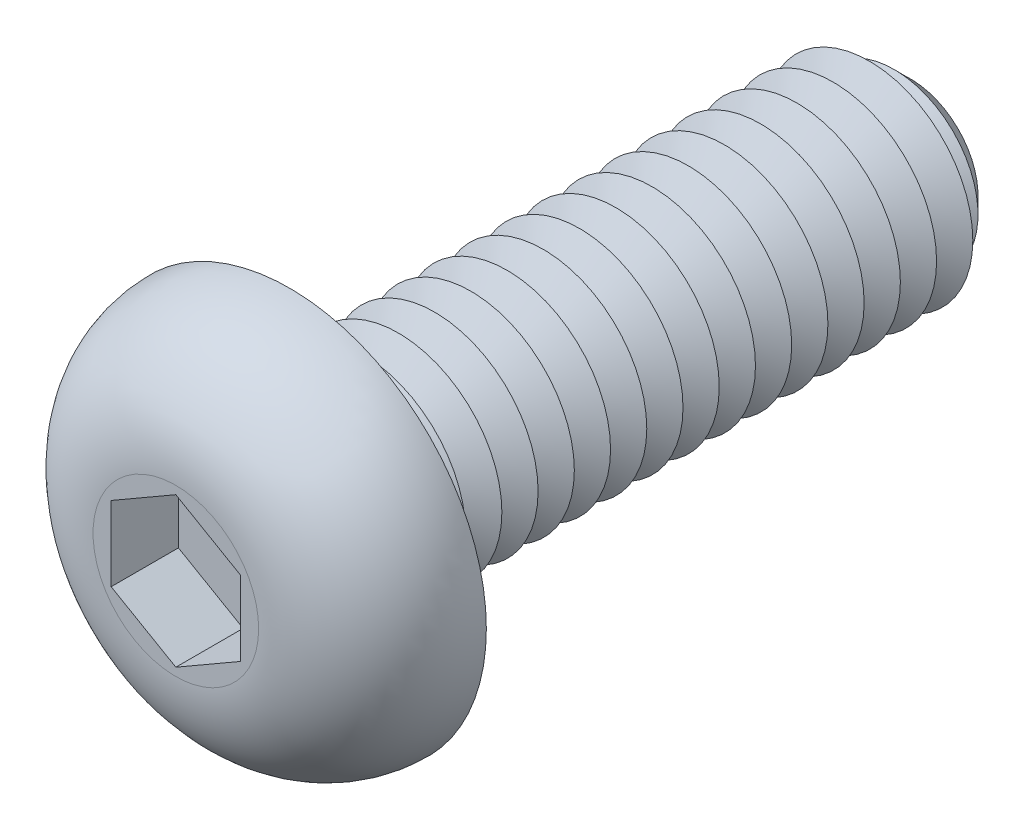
ISO-10303-21;
HEADER;
FILE_DESCRIPTION(('STEP AP214'),'2;1');
FILE_NAME('part.step','',(''),(''),'','','');
FILE_SCHEMA(('AUTOMOTIVE_DESIGN { 1 0 10303 214 1 1 1 1 }'));
ENDSEC;
DATA;
#1=APPLICATION_CONTEXT('core data for automotive mechanical design processes');
#2=APPLICATION_PROTOCOL_DEFINITION('international standard','automotive_design',2000,#1);
#3=PRODUCT_CONTEXT('',#1,'mechanical');
#4=PRODUCT('Part','Part','',(#3));
#5=PRODUCT_RELATED_PRODUCT_CATEGORY('part','',(#4));
#6=PRODUCT_DEFINITION_FORMATION('','',#4);
#7=PRODUCT_DEFINITION_CONTEXT('part definition',#1,'design');
#8=PRODUCT_DEFINITION('design','',#6,#7);
#9=PRODUCT_DEFINITION_SHAPE('','',#8);
#10=(LENGTH_UNIT() NAMED_UNIT(*) SI_UNIT(.MILLI.,.METRE.));
#11=(NAMED_UNIT(*) PLANE_ANGLE_UNIT() SI_UNIT($,.RADIAN.));
#12=(NAMED_UNIT(*) SI_UNIT($,.STERADIAN.) SOLID_ANGLE_UNIT());
#13=UNCERTAINTY_MEASURE_WITH_UNIT(LENGTH_MEASURE(1.E-05),#10,'distance_accuracy_value','');
#14=(GEOMETRIC_REPRESENTATION_CONTEXT(3) GLOBAL_UNCERTAINTY_ASSIGNED_CONTEXT((#13)) GLOBAL_UNIT_ASSIGNED_CONTEXT((#10,
#11,#12)) REPRESENTATION_CONTEXT('',''));
#15=CARTESIAN_POINT('',(0.,0.,0.));
#16=DIRECTION('',(0.,0.,1.));
#17=DIRECTION('',(1.,0.,0.));
#18=AXIS2_PLACEMENT_3D('',#15,#16,#17);
#19=CARTESIAN_POINT('',(0.,0.,-12.));
#20=DIRECTION('',(0.,0.,1.));
#21=DIRECTION('',(1.,0.,0.));
#22=AXIS2_PLACEMENT_3D('',#19,#20,#21);
#23=CYLINDRICAL_SURFACE('',#22,2.);
#24=CARTESIAN_POINT('',(0.,0.,-0.35));
#25=DIRECTION('',(0.,0.,1.));
#26=DIRECTION('',(1.,0.,0.));
#27=AXIS2_PLACEMENT_3D('',#24,#25,#26);
#28=CIRCLE('',#27,2.);
#29=CARTESIAN_POINT('',(2.,0.,-0.35));
#30=VERTEX_POINT('',#29);
#31=EDGE_CURVE('E48',#30,#30,#28,.F.);
#32=ORIENTED_EDGE('',*,*,#31,.T.);
#33=EDGE_LOOP('',(#32));
#34=FACE_BOUND('',#33,.T.);
#35=CARTESIAN_POINT('',(0.,0.,-0.699999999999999));
#36=DIRECTION('',(0.,0.,1.));
#37=DIRECTION('',(1.,0.,0.));
#38=AXIS2_PLACEMENT_3D('',#35,#36,#37);
#39=CIRCLE('',#38,2.);
#40=CARTESIAN_POINT('',(2.,0.,-0.699999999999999));
#41=VERTEX_POINT('',#40);
#42=EDGE_CURVE('E138',#41,#41,#39,.T.);
#43=ORIENTED_EDGE('',*,*,#42,.T.);
#44=EDGE_LOOP('',(#43));
#45=FACE_BOUND('',#44,.T.);
#46=ADVANCED_FACE('F39',(#34,#45),#23,.T.);
#47=CARTESIAN_POINT('',(0.,3.8,0.));
#48=DIRECTION('',(0.,0.,1.));
#49=DIRECTION('',(1.,0.,0.));
#50=AXIS2_PLACEMENT_3D('',#47,#48,#49);
#51=PLANE('',#50);
#52=CARTESIAN_POINT('',(0.,0.,0.));
#53=DIRECTION('',(0.,0.,1.));
#54=DIRECTION('',(1.,0.,0.));
#55=AXIS2_PLACEMENT_3D('',#52,#53,#54);
#56=CIRCLE('',#55,2.35);
#57=CARTESIAN_POINT('',(2.35,0.,0.));
#58=VERTEX_POINT('',#57);
#59=EDGE_CURVE('E11',#58,#58,#56,.T.);
#60=ORIENTED_EDGE('',*,*,#59,.T.);
#61=EDGE_LOOP('',(#60));
#62=FACE_BOUND('',#61,.T.);
#63=CARTESIAN_POINT('',(0.,0.,0.));
#64=DIRECTION('',(0.,0.,1.));
#65=DIRECTION('',(1.,0.,0.));
#66=AXIS2_PLACEMENT_3D('',#63,#64,#65);
#67=CIRCLE('',#66,3.8);
#68=CARTESIAN_POINT('',(3.8,0.,0.));
#69=VERTEX_POINT('',#68);
#70=EDGE_CURVE('E156',#69,#69,#67,.T.);
#71=ORIENTED_EDGE('',*,*,#70,.F.);
#72=EDGE_LOOP('',(#71));
#73=FACE_BOUND('',#72,.T.);
#74=ADVANCED_FACE('F203',(#62,#73),#51,.F.);
#75=CARTESIAN_POINT('',(0.,0.,2.2));
#76=DIRECTION('',(0.,0.,-1.));
#77=DIRECTION('',(-1.,0.,0.));
#78=AXIS2_PLACEMENT_3D('',#75,#76,#77);
#79=PLANE('',#78);
#80=DIRECTION('',(-0.866025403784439,-0.5,0.));
#81=VECTOR('',#80,1.);
#82=CARTESIAN_POINT('',(0.,1.44337567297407,2.2));
#83=LINE('',#82,#81);
#84=CARTESIAN_POINT('',(0.,1.44337567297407,2.2));
#85=VERTEX_POINT('',#84);
#86=CARTESIAN_POINT('',(-1.25,0.721687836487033,2.2));
#87=VERTEX_POINT('',#86);
#88=EDGE_CURVE('E137',#85,#87,#83,.T.);
#89=ORIENTED_EDGE('',*,*,#88,.F.);
#90=DIRECTION('',(-0.866025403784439,0.5,0.));
#91=VECTOR('',#90,1.);
#92=CARTESIAN_POINT('',(1.25,0.721687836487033,2.2));
#93=LINE('',#92,#91);
#94=CARTESIAN_POINT('',(1.25,0.721687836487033,2.2));
#95=VERTEX_POINT('',#94);
#96=EDGE_CURVE('E55',#95,#85,#93,.T.);
#97=ORIENTED_EDGE('',*,*,#96,.F.);
#98=DIRECTION('',(0.,1.,0.));
#99=VECTOR('',#98,1.);
#100=CARTESIAN_POINT('',(1.25,-0.721687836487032,2.2));
#101=LINE('',#100,#99);
#102=CARTESIAN_POINT('',(1.25,-0.721687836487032,2.2));
#103=VERTEX_POINT('',#102);
#104=EDGE_CURVE('E150',#103,#95,#101,.T.);
#105=ORIENTED_EDGE('',*,*,#104,.F.);
#106=DIRECTION('',(0.866025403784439,0.5,0.));
#107=VECTOR('',#106,1.);
#108=CARTESIAN_POINT('',(0.,-1.44337567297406,2.2));
#109=LINE('',#108,#107);
#110=CARTESIAN_POINT('',(0.,-1.44337567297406,2.2));
#111=VERTEX_POINT('',#110);
#112=EDGE_CURVE('E147',#111,#103,#109,.T.);
#113=ORIENTED_EDGE('',*,*,#112,.F.);
#114=DIRECTION('',(0.866025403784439,-0.5,0.));
#115=VECTOR('',#114,1.);
#116=CARTESIAN_POINT('',(-1.25,-0.721687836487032,2.2));
#117=LINE('',#116,#115);
#118=CARTESIAN_POINT('',(-1.25,-0.721687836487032,2.2));
#119=VERTEX_POINT('',#118);
#120=EDGE_CURVE('E103',#119,#111,#117,.T.);
#121=ORIENTED_EDGE('',*,*,#120,.F.);
#122=DIRECTION('',(0.,-1.,0.));
#123=VECTOR('',#122,1.);
#124=CARTESIAN_POINT('',(-1.25,0.721687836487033,2.2));
#125=LINE('',#124,#123);
#126=EDGE_CURVE('E141',#87,#119,#125,.T.);
#127=ORIENTED_EDGE('',*,*,#126,.F.);
#128=EDGE_LOOP('',(#89,#97,#105,#113,#121,#127));
#129=FACE_BOUND('',#128,.T.);
#130=CARTESIAN_POINT('',(0.,0.,2.2));
#131=DIRECTION('',(0.,0.,1.));
#132=DIRECTION('',(1.,0.,0.));
#133=AXIS2_PLACEMENT_3D('',#130,#131,#132);
#134=CIRCLE('',#133,1.6);
#135=CARTESIAN_POINT('',(1.6,0.,2.2));
#136=VERTEX_POINT('',#135);
#137=EDGE_CURVE('E169',#136,#136,#134,.T.);
#138=ORIENTED_EDGE('',*,*,#137,.T.);
#139=EDGE_LOOP('',(#138));
#140=FACE_BOUND('',#139,.T.);
#141=ADVANCED_FACE('F208',(#129,#140),#79,.F.);
#142=CARTESIAN_POINT('',(0.,0.,0.));
#143=DIRECTION('',(0.,0.,1.));
#144=DIRECTION('',(1.,0.,0.));
#145=AXIS2_PLACEMENT_3D('',#142,#143,#144);
#146=DEGENERATE_TOROIDAL_SURFACE('',#145,1.6,2.2,.T.);
#147=ORIENTED_EDGE('',*,*,#137,.F.);
#148=EDGE_LOOP('',(#147));
#149=FACE_BOUND('',#148,.T.);
#150=ORIENTED_EDGE('',*,*,#70,.T.);
#151=EDGE_LOOP('',(#150));
#152=FACE_BOUND('',#151,.T.);
#153=ADVANCED_FACE('F236',(#149,#152),#146,.T.);
#154=CARTESIAN_POINT('',(1.25,0.721687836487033,0.9));
#155=DIRECTION('',(0.5,0.866025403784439,0.));
#156=DIRECTION('',(-0.866025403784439,0.5,0.));
#157=AXIS2_PLACEMENT_3D('',#154,#155,#156);
#158=PLANE('',#157);
#159=ORIENTED_EDGE('',*,*,#96,.T.);
#160=DIRECTION('',(0.,0.,1.));
#161=VECTOR('',#160,1.);
#162=CARTESIAN_POINT('',(0.,1.44337567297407,0.9));
#163=LINE('',#162,#161);
#164=CARTESIAN_POINT('',(0.,1.44337567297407,0.9));
#165=VERTEX_POINT('',#164);
#166=EDGE_CURVE('E85',#165,#85,#163,.T.);
#167=ORIENTED_EDGE('',*,*,#166,.F.);
#168=DIRECTION('',(-0.866025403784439,0.5,0.));
#169=VECTOR('',#168,1.);
#170=CARTESIAN_POINT('',(1.25,0.721687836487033,0.9));
#171=LINE('',#170,#169);
#172=CARTESIAN_POINT('',(1.25,0.721687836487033,0.9));
#173=VERTEX_POINT('',#172);
#174=EDGE_CURVE('E153',#173,#165,#171,.T.);
#175=ORIENTED_EDGE('',*,*,#174,.F.);
#176=DIRECTION('',(0.,0.,1.));
#177=VECTOR('',#176,1.);
#178=CARTESIAN_POINT('',(1.25,0.721687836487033,0.9));
#179=LINE('',#178,#177);
#180=EDGE_CURVE('E63',#173,#95,#179,.T.);
#181=ORIENTED_EDGE('',*,*,#180,.T.);
#182=EDGE_LOOP('',(#159,#167,#175,#181));
#183=FACE_BOUND('',#182,.T.);
#184=ADVANCED_FACE('F222',(#183),#158,.F.);
#185=CARTESIAN_POINT('',(1.25,-0.721687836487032,0.9));
#186=DIRECTION('',(1.,0.,0.));
#187=DIRECTION('',(0.,1.,0.));
#188=AXIS2_PLACEMENT_3D('',#185,#186,#187);
#189=PLANE('',#188);
#190=ORIENTED_EDGE('',*,*,#104,.T.);
#191=ORIENTED_EDGE('',*,*,#180,.F.);
#192=DIRECTION('',(0.,1.,0.));
#193=VECTOR('',#192,1.);
#194=CARTESIAN_POINT('',(1.25,-0.721687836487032,0.9));
#195=LINE('',#194,#193);
#196=CARTESIAN_POINT('',(1.25,-0.721687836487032,0.9));
#197=VERTEX_POINT('',#196);
#198=EDGE_CURVE('E117',#197,#173,#195,.T.);
#199=ORIENTED_EDGE('',*,*,#198,.F.);
#200=DIRECTION('',(0.,0.,1.));
#201=VECTOR('',#200,1.);
#202=CARTESIAN_POINT('',(1.25,-0.721687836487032,0.9));
#203=LINE('',#202,#201);
#204=EDGE_CURVE('E108',#197,#103,#203,.T.);
#205=ORIENTED_EDGE('',*,*,#204,.T.);
#206=EDGE_LOOP('',(#190,#191,#199,#205));
#207=FACE_BOUND('',#206,.T.);
#208=ADVANCED_FACE('F219',(#207),#189,.F.);
#209=CARTESIAN_POINT('',(0.,-1.44337567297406,0.9));
#210=DIRECTION('',(0.5,-0.866025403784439,0.));
#211=DIRECTION('',(0.866025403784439,0.5,0.));
#212=AXIS2_PLACEMENT_3D('',#209,#210,#211);
#213=PLANE('',#212);
#214=ORIENTED_EDGE('',*,*,#112,.T.);
#215=ORIENTED_EDGE('',*,*,#204,.F.);
#216=DIRECTION('',(0.866025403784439,0.5,0.));
#217=VECTOR('',#216,1.);
#218=CARTESIAN_POINT('',(0.,-1.44337567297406,0.9));
#219=LINE('',#218,#217);
#220=CARTESIAN_POINT('',(0.,-1.44337567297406,0.9));
#221=VERTEX_POINT('',#220);
#222=EDGE_CURVE('E112',#221,#197,#219,.T.);
#223=ORIENTED_EDGE('',*,*,#222,.F.);
#224=DIRECTION('',(0.,0.,1.));
#225=VECTOR('',#224,1.);
#226=CARTESIAN_POINT('',(0.,-1.44337567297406,0.9));
#227=LINE('',#226,#225);
#228=EDGE_CURVE('E96',#221,#111,#227,.T.);
#229=ORIENTED_EDGE('',*,*,#228,.T.);
#230=EDGE_LOOP('',(#214,#215,#223,#229));
#231=FACE_BOUND('',#230,.T.);
#232=ADVANCED_FACE('F113',(#231),#213,.F.);
#233=CARTESIAN_POINT('',(-1.25,-0.721687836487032,0.9));
#234=DIRECTION('',(-0.5,-0.866025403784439,0.));
#235=DIRECTION('',(0.866025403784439,-0.5,0.));
#236=AXIS2_PLACEMENT_3D('',#233,#234,#235);
#237=PLANE('',#236);
#238=ORIENTED_EDGE('',*,*,#120,.T.);
#239=ORIENTED_EDGE('',*,*,#228,.F.);
#240=DIRECTION('',(0.866025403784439,-0.5,0.));
#241=VECTOR('',#240,1.);
#242=CARTESIAN_POINT('',(-1.25,-0.721687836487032,0.9));
#243=LINE('',#242,#241);
#244=CARTESIAN_POINT('',(-1.25,-0.721687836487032,0.9));
#245=VERTEX_POINT('',#244);
#246=EDGE_CURVE('E100',#245,#221,#243,.T.);
#247=ORIENTED_EDGE('',*,*,#246,.F.);
#248=DIRECTION('',(0.,0.,1.));
#249=VECTOR('',#248,1.);
#250=CARTESIAN_POINT('',(-1.25,-0.721687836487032,0.9));
#251=LINE('',#250,#249);
#252=EDGE_CURVE('E109',#245,#119,#251,.T.);
#253=ORIENTED_EDGE('',*,*,#252,.T.);
#254=EDGE_LOOP('',(#238,#239,#247,#253));
#255=FACE_BOUND('',#254,.T.);
#256=ADVANCED_FACE('F98',(#255),#237,.F.);
#257=CARTESIAN_POINT('',(-1.25,0.721687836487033,0.9));
#258=DIRECTION('',(-1.,0.,0.));
#259=DIRECTION('',(0.,-1.,0.));
#260=AXIS2_PLACEMENT_3D('',#257,#258,#259);
#261=PLANE('',#260);
#262=ORIENTED_EDGE('',*,*,#126,.T.);
#263=ORIENTED_EDGE('',*,*,#252,.F.);
#264=DIRECTION('',(0.,-1.,0.));
#265=VECTOR('',#264,1.);
#266=CARTESIAN_POINT('',(-1.25,0.721687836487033,0.9));
#267=LINE('',#266,#265);
#268=CARTESIAN_POINT('',(-1.25,0.721687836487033,0.9));
#269=VERTEX_POINT('',#268);
#270=EDGE_CURVE('E123',#269,#245,#267,.T.);
#271=ORIENTED_EDGE('',*,*,#270,.F.);
#272=DIRECTION('',(0.,0.,1.));
#273=VECTOR('',#272,1.);
#274=CARTESIAN_POINT('',(-1.25,0.721687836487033,0.9));
#275=LINE('',#274,#273);
#276=EDGE_CURVE('E161',#269,#87,#275,.T.);
#277=ORIENTED_EDGE('',*,*,#276,.T.);
#278=EDGE_LOOP('',(#262,#263,#271,#277));
#279=FACE_BOUND('',#278,.T.);
#280=ADVANCED_FACE('F227',(#279),#261,.F.);
#281=CARTESIAN_POINT('',(0.,1.44337567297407,0.9));
#282=DIRECTION('',(-0.5,0.866025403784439,0.));
#283=DIRECTION('',(-0.866025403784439,-0.5,0.));
#284=AXIS2_PLACEMENT_3D('',#281,#282,#283);
#285=PLANE('',#284);
#286=ORIENTED_EDGE('',*,*,#88,.T.);
#287=ORIENTED_EDGE('',*,*,#276,.F.);
#288=DIRECTION('',(-0.866025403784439,-0.5,0.));
#289=VECTOR('',#288,1.);
#290=CARTESIAN_POINT('',(0.,1.44337567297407,0.9));
#291=LINE('',#290,#289);
#292=EDGE_CURVE('E129',#165,#269,#291,.T.);
#293=ORIENTED_EDGE('',*,*,#292,.F.);
#294=ORIENTED_EDGE('',*,*,#166,.T.);
#295=EDGE_LOOP('',(#286,#287,#293,#294));
#296=FACE_BOUND('',#295,.T.);
#297=ADVANCED_FACE('F217',(#296),#285,.F.);
#298=CARTESIAN_POINT('',(0.,0.,0.9));
#299=DIRECTION('',(0.,0.,1.));
#300=DIRECTION('',(1.,0.,0.));
#301=AXIS2_PLACEMENT_3D('',#298,#299,#300);
#302=PLANE('',#301);
#303=CARTESIAN_POINT('',(0.,0.,0.9));
#304=DIRECTION('',(0.,0.,1.));
#305=DIRECTION('',(1.,0.,0.));
#306=AXIS2_PLACEMENT_3D('',#303,#304,#305);
#307=CIRCLE('',#306,0.5);
#308=CARTESIAN_POINT('',(0.5,0.,0.9));
#309=VERTEX_POINT('',#308);
#310=EDGE_CURVE('E383',#309,#309,#307,.T.);
#311=ORIENTED_EDGE('',*,*,#310,.F.);
#312=EDGE_LOOP('',(#311));
#313=FACE_BOUND('',#312,.T.);
#314=ORIENTED_EDGE('',*,*,#174,.T.);
#315=ORIENTED_EDGE('',*,*,#292,.T.);
#316=ORIENTED_EDGE('',*,*,#270,.T.);
#317=ORIENTED_EDGE('',*,*,#246,.T.);
#318=ORIENTED_EDGE('',*,*,#222,.T.);
#319=ORIENTED_EDGE('',*,*,#198,.T.);
#320=EDGE_LOOP('',(#314,#315,#316,#317,#318,#319));
#321=FACE_BOUND('',#320,.T.);
#322=ADVANCED_FACE('F120',(#313,#321),#302,.T.);
#323=CARTESIAN_POINT('',(0.,0.,-0.699999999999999));
#324=DIRECTION('',(0.,0.,1.));
#325=DIRECTION('',(1.,0.,0.));
#326=AXIS2_PLACEMENT_3D('',#323,#324,#325);
#327=CONICAL_SURFACE('',#326,2.,1.04719755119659);
#328=CARTESIAN_POINT('',(0.,0.,-1.05));
#329=DIRECTION('',(0.,0.,1.));
#330=DIRECTION('',(1.,0.,0.));
#331=AXIS2_PLACEMENT_3D('',#328,#329,#330);
#332=CIRCLE('',#331,1.39378221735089);
#333=CARTESIAN_POINT('',(1.39378221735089,0.,-1.05));
#334=VERTEX_POINT('',#333);
#335=EDGE_CURVE('E261',#334,#334,#332,.T.);
#336=ORIENTED_EDGE('',*,*,#335,.T.);
#337=EDGE_LOOP('',(#336));
#338=FACE_BOUND('',#337,.T.);
#339=ORIENTED_EDGE('',*,*,#42,.F.);
#340=EDGE_LOOP('',(#339));
#341=FACE_BOUND('',#340,.T.);
#342=ADVANCED_FACE('F216',(#338,#341),#327,.T.);
#343=CARTESIAN_POINT('',(0.,0.,-1.05));
#344=DIRECTION('',(0.,0.,-1.));
#345=DIRECTION('',(-1.,0.,0.));
#346=AXIS2_PLACEMENT_3D('',#343,#344,#345);
#347=CONICAL_SURFACE('',#346,1.39378221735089,1.0471975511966);
#348=CARTESIAN_POINT('',(0.,0.,-1.4));
#349=DIRECTION('',(0.,0.,1.));
#350=DIRECTION('',(1.,0.,0.));
#351=AXIS2_PLACEMENT_3D('',#348,#349,#350);
#352=CIRCLE('',#351,2.);
#353=CARTESIAN_POINT('',(2.,0.,-1.4));
#354=VERTEX_POINT('',#353);
#355=EDGE_CURVE('E265',#354,#354,#352,.T.);
#356=ORIENTED_EDGE('',*,*,#355,.T.);
#357=EDGE_LOOP('',(#356));
#358=FACE_BOUND('',#357,.T.);
#359=ORIENTED_EDGE('',*,*,#335,.F.);
#360=EDGE_LOOP('',(#359));
#361=FACE_BOUND('',#360,.T.);
#362=ADVANCED_FACE('F573',(#358,#361),#347,.T.);
#363=CARTESIAN_POINT('',(0.,0.,-1.4));
#364=DIRECTION('',(0.,0.,1.));
#365=DIRECTION('',(1.,0.,0.));
#366=AXIS2_PLACEMENT_3D('',#363,#364,#365);
#367=CONICAL_SURFACE('',#366,2.,1.04719755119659);
#368=CARTESIAN_POINT('',(0.,0.,-1.75));
#369=DIRECTION('',(0.,0.,1.));
#370=DIRECTION('',(1.,0.,0.));
#371=AXIS2_PLACEMENT_3D('',#368,#369,#370);
#372=CIRCLE('',#371,1.39378221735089);
#373=CARTESIAN_POINT('',(1.39378221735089,0.,-1.75));
#374=VERTEX_POINT('',#373);
#375=EDGE_CURVE('E269',#374,#374,#372,.T.);
#376=ORIENTED_EDGE('',*,*,#375,.T.);
#377=EDGE_LOOP('',(#376));
#378=FACE_BOUND('',#377,.T.);
#379=ORIENTED_EDGE('',*,*,#355,.F.);
#380=EDGE_LOOP('',(#379));
#381=FACE_BOUND('',#380,.T.);
#382=ADVANCED_FACE('F567',(#378,#381),#367,.T.);
#383=CARTESIAN_POINT('',(0.,0.,-1.75));
#384=DIRECTION('',(0.,0.,-1.));
#385=DIRECTION('',(-1.,0.,0.));
#386=AXIS2_PLACEMENT_3D('',#383,#384,#385);
#387=CONICAL_SURFACE('',#386,1.39378221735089,1.0471975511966);
#388=CARTESIAN_POINT('',(0.,0.,-2.1));
#389=DIRECTION('',(0.,0.,1.));
#390=DIRECTION('',(1.,0.,0.));
#391=AXIS2_PLACEMENT_3D('',#388,#389,#390);
#392=CIRCLE('',#391,2.);
#393=CARTESIAN_POINT('',(2.,0.,-2.1));
#394=VERTEX_POINT('',#393);
#395=EDGE_CURVE('E273',#394,#394,#392,.T.);
#396=ORIENTED_EDGE('',*,*,#395,.T.);
#397=EDGE_LOOP('',(#396));
#398=FACE_BOUND('',#397,.T.);
#399=ORIENTED_EDGE('',*,*,#375,.F.);
#400=EDGE_LOOP('',(#399));
#401=FACE_BOUND('',#400,.T.);
#402=ADVANCED_FACE('F561',(#398,#401),#387,.T.);
#403=CARTESIAN_POINT('',(0.,0.,-2.1));
#404=DIRECTION('',(0.,0.,1.));
#405=DIRECTION('',(1.,0.,0.));
#406=AXIS2_PLACEMENT_3D('',#403,#404,#405);
#407=CONICAL_SURFACE('',#406,2.,1.04719755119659);
#408=CARTESIAN_POINT('',(0.,0.,-2.45));
#409=DIRECTION('',(0.,0.,1.));
#410=DIRECTION('',(1.,0.,0.));
#411=AXIS2_PLACEMENT_3D('',#408,#409,#410);
#412=CIRCLE('',#411,1.39378221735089);
#413=CARTESIAN_POINT('',(1.39378221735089,0.,-2.45));
#414=VERTEX_POINT('',#413);
#415=EDGE_CURVE('E276',#414,#414,#412,.T.);
#416=ORIENTED_EDGE('',*,*,#415,.T.);
#417=EDGE_LOOP('',(#416));
#418=FACE_BOUND('',#417,.T.);
#419=ORIENTED_EDGE('',*,*,#395,.F.);
#420=EDGE_LOOP('',(#419));
#421=FACE_BOUND('',#420,.T.);
#422=ADVANCED_FACE('F555',(#418,#421),#407,.T.);
#423=CARTESIAN_POINT('',(0.,0.,-2.45));
#424=DIRECTION('',(0.,0.,-1.));
#425=DIRECTION('',(-1.,0.,0.));
#426=AXIS2_PLACEMENT_3D('',#423,#424,#425);
#427=CONICAL_SURFACE('',#426,1.39378221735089,1.0471975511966);
#428=CARTESIAN_POINT('',(0.,0.,-2.8));
#429=DIRECTION('',(0.,0.,1.));
#430=DIRECTION('',(1.,0.,0.));
#431=AXIS2_PLACEMENT_3D('',#428,#429,#430);
#432=CIRCLE('',#431,2.);
#433=CARTESIAN_POINT('',(2.,0.,-2.8));
#434=VERTEX_POINT('',#433);
#435=EDGE_CURVE('E280',#434,#434,#432,.T.);
#436=ORIENTED_EDGE('',*,*,#435,.T.);
#437=EDGE_LOOP('',(#436));
#438=FACE_BOUND('',#437,.T.);
#439=ORIENTED_EDGE('',*,*,#415,.F.);
#440=EDGE_LOOP('',(#439));
#441=FACE_BOUND('',#440,.T.);
#442=ADVANCED_FACE('F549',(#438,#441),#427,.T.);
#443=CARTESIAN_POINT('',(0.,0.,-2.8));
#444=DIRECTION('',(0.,0.,1.));
#445=DIRECTION('',(1.,0.,0.));
#446=AXIS2_PLACEMENT_3D('',#443,#444,#445);
#447=CONICAL_SURFACE('',#446,2.,1.04719755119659);
#448=CARTESIAN_POINT('',(0.,0.,-3.15));
#449=DIRECTION('',(0.,0.,1.));
#450=DIRECTION('',(1.,0.,0.));
#451=AXIS2_PLACEMENT_3D('',#448,#449,#450);
#452=CIRCLE('',#451,1.39378221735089);
#453=CARTESIAN_POINT('',(1.39378221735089,0.,-3.15));
#454=VERTEX_POINT('',#453);
#455=EDGE_CURVE('E284',#454,#454,#452,.T.);
#456=ORIENTED_EDGE('',*,*,#455,.T.);
#457=EDGE_LOOP('',(#456));
#458=FACE_BOUND('',#457,.T.);
#459=ORIENTED_EDGE('',*,*,#435,.F.);
#460=EDGE_LOOP('',(#459));
#461=FACE_BOUND('',#460,.T.);
#462=ADVANCED_FACE('F543',(#458,#461),#447,.T.);
#463=CARTESIAN_POINT('',(0.,0.,-3.15));
#464=DIRECTION('',(0.,0.,-1.));
#465=DIRECTION('',(-1.,0.,0.));
#466=AXIS2_PLACEMENT_3D('',#463,#464,#465);
#467=CONICAL_SURFACE('',#466,1.39378221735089,1.0471975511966);
#468=CARTESIAN_POINT('',(0.,0.,-3.5));
#469=DIRECTION('',(0.,0.,1.));
#470=DIRECTION('',(1.,0.,0.));
#471=AXIS2_PLACEMENT_3D('',#468,#469,#470);
#472=CIRCLE('',#471,2.);
#473=CARTESIAN_POINT('',(2.,0.,-3.5));
#474=VERTEX_POINT('',#473);
#475=EDGE_CURVE('E288',#474,#474,#472,.T.);
#476=ORIENTED_EDGE('',*,*,#475,.T.);
#477=EDGE_LOOP('',(#476));
#478=FACE_BOUND('',#477,.T.);
#479=ORIENTED_EDGE('',*,*,#455,.F.);
#480=EDGE_LOOP('',(#479));
#481=FACE_BOUND('',#480,.T.);
#482=ADVANCED_FACE('F537',(#478,#481),#467,.T.);
#483=CARTESIAN_POINT('',(0.,0.,-3.5));
#484=DIRECTION('',(0.,0.,1.));
#485=DIRECTION('',(1.,0.,0.));
#486=AXIS2_PLACEMENT_3D('',#483,#484,#485);
#487=CONICAL_SURFACE('',#486,2.,1.04719755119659);
#488=CARTESIAN_POINT('',(0.,0.,-3.85));
#489=DIRECTION('',(0.,0.,1.));
#490=DIRECTION('',(1.,0.,0.));
#491=AXIS2_PLACEMENT_3D('',#488,#489,#490);
#492=CIRCLE('',#491,1.39378221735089);
#493=CARTESIAN_POINT('',(1.39378221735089,0.,-3.85));
#494=VERTEX_POINT('',#493);
#495=EDGE_CURVE('E292',#494,#494,#492,.T.);
#496=ORIENTED_EDGE('',*,*,#495,.T.);
#497=EDGE_LOOP('',(#496));
#498=FACE_BOUND('',#497,.T.);
#499=ORIENTED_EDGE('',*,*,#475,.F.);
#500=EDGE_LOOP('',(#499));
#501=FACE_BOUND('',#500,.T.);
#502=ADVANCED_FACE('F531',(#498,#501),#487,.T.);
#503=CARTESIAN_POINT('',(0.,0.,-3.85));
#504=DIRECTION('',(0.,0.,-1.));
#505=DIRECTION('',(-1.,0.,0.));
#506=AXIS2_PLACEMENT_3D('',#503,#504,#505);
#507=CONICAL_SURFACE('',#506,1.39378221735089,1.0471975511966);
#508=CARTESIAN_POINT('',(0.,0.,-4.2));
#509=DIRECTION('',(0.,0.,1.));
#510=DIRECTION('',(1.,0.,0.));
#511=AXIS2_PLACEMENT_3D('',#508,#509,#510);
#512=CIRCLE('',#511,2.);
#513=CARTESIAN_POINT('',(2.,0.,-4.2));
#514=VERTEX_POINT('',#513);
#515=EDGE_CURVE('E296',#514,#514,#512,.T.);
#516=ORIENTED_EDGE('',*,*,#515,.T.);
#517=EDGE_LOOP('',(#516));
#518=FACE_BOUND('',#517,.T.);
#519=ORIENTED_EDGE('',*,*,#495,.F.);
#520=EDGE_LOOP('',(#519));
#521=FACE_BOUND('',#520,.T.);
#522=ADVANCED_FACE('F525',(#518,#521),#507,.T.);
#523=CARTESIAN_POINT('',(0.,0.,-4.2));
#524=DIRECTION('',(0.,0.,1.));
#525=DIRECTION('',(1.,0.,0.));
#526=AXIS2_PLACEMENT_3D('',#523,#524,#525);
#527=CONICAL_SURFACE('',#526,2.,1.04719755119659);
#528=CARTESIAN_POINT('',(0.,0.,-4.55));
#529=DIRECTION('',(0.,0.,1.));
#530=DIRECTION('',(1.,0.,0.));
#531=AXIS2_PLACEMENT_3D('',#528,#529,#530);
#532=CIRCLE('',#531,1.39378221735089);
#533=CARTESIAN_POINT('',(1.39378221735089,0.,-4.55));
#534=VERTEX_POINT('',#533);
#535=EDGE_CURVE('E300',#534,#534,#532,.T.);
#536=ORIENTED_EDGE('',*,*,#535,.T.);
#537=EDGE_LOOP('',(#536));
#538=FACE_BOUND('',#537,.T.);
#539=ORIENTED_EDGE('',*,*,#515,.F.);
#540=EDGE_LOOP('',(#539));
#541=FACE_BOUND('',#540,.T.);
#542=ADVANCED_FACE('F519',(#538,#541),#527,.T.);
#543=CARTESIAN_POINT('',(0.,0.,-4.55));
#544=DIRECTION('',(0.,0.,-1.));
#545=DIRECTION('',(-1.,0.,0.));
#546=AXIS2_PLACEMENT_3D('',#543,#544,#545);
#547=CONICAL_SURFACE('',#546,1.39378221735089,1.0471975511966);
#548=CARTESIAN_POINT('',(0.,0.,-4.9));
#549=DIRECTION('',(0.,0.,1.));
#550=DIRECTION('',(1.,0.,0.));
#551=AXIS2_PLACEMENT_3D('',#548,#549,#550);
#552=CIRCLE('',#551,2.);
#553=CARTESIAN_POINT('',(2.,0.,-4.9));
#554=VERTEX_POINT('',#553);
#555=EDGE_CURVE('E304',#554,#554,#552,.T.);
#556=ORIENTED_EDGE('',*,*,#555,.T.);
#557=EDGE_LOOP('',(#556));
#558=FACE_BOUND('',#557,.T.);
#559=ORIENTED_EDGE('',*,*,#535,.F.);
#560=EDGE_LOOP('',(#559));
#561=FACE_BOUND('',#560,.T.);
#562=ADVANCED_FACE('F513',(#558,#561),#547,.T.);
#563=CARTESIAN_POINT('',(0.,0.,-4.9));
#564=DIRECTION('',(0.,0.,1.));
#565=DIRECTION('',(1.,0.,0.));
#566=AXIS2_PLACEMENT_3D('',#563,#564,#565);
#567=CONICAL_SURFACE('',#566,2.,1.04719755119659);
#568=CARTESIAN_POINT('',(0.,0.,-5.25));
#569=DIRECTION('',(0.,0.,1.));
#570=DIRECTION('',(1.,0.,0.));
#571=AXIS2_PLACEMENT_3D('',#568,#569,#570);
#572=CIRCLE('',#571,1.39378221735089);
#573=CARTESIAN_POINT('',(1.39378221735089,0.,-5.25));
#574=VERTEX_POINT('',#573);
#575=EDGE_CURVE('E308',#574,#574,#572,.T.);
#576=ORIENTED_EDGE('',*,*,#575,.T.);
#577=EDGE_LOOP('',(#576));
#578=FACE_BOUND('',#577,.T.);
#579=ORIENTED_EDGE('',*,*,#555,.F.);
#580=EDGE_LOOP('',(#579));
#581=FACE_BOUND('',#580,.T.);
#582=ADVANCED_FACE('F507',(#578,#581),#567,.T.);
#583=CARTESIAN_POINT('',(0.,0.,-5.25));
#584=DIRECTION('',(0.,0.,-1.));
#585=DIRECTION('',(-1.,0.,0.));
#586=AXIS2_PLACEMENT_3D('',#583,#584,#585);
#587=CONICAL_SURFACE('',#586,1.39378221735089,1.0471975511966);
#588=CARTESIAN_POINT('',(0.,0.,-5.6));
#589=DIRECTION('',(0.,0.,1.));
#590=DIRECTION('',(1.,0.,0.));
#591=AXIS2_PLACEMENT_3D('',#588,#589,#590);
#592=CIRCLE('',#591,2.);
#593=CARTESIAN_POINT('',(2.,0.,-5.6));
#594=VERTEX_POINT('',#593);
#595=EDGE_CURVE('E311',#594,#594,#592,.T.);
#596=ORIENTED_EDGE('',*,*,#595,.T.);
#597=EDGE_LOOP('',(#596));
#598=FACE_BOUND('',#597,.T.);
#599=ORIENTED_EDGE('',*,*,#575,.F.);
#600=EDGE_LOOP('',(#599));
#601=FACE_BOUND('',#600,.T.);
#602=ADVANCED_FACE('F501',(#598,#601),#587,.T.);
#603=CARTESIAN_POINT('',(0.,0.,-5.6));
#604=DIRECTION('',(0.,0.,1.));
#605=DIRECTION('',(1.,0.,0.));
#606=AXIS2_PLACEMENT_3D('',#603,#604,#605);
#607=CONICAL_SURFACE('',#606,2.,1.04719755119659);
#608=CARTESIAN_POINT('',(0.,0.,-5.95));
#609=DIRECTION('',(0.,0.,1.));
#610=DIRECTION('',(1.,0.,0.));
#611=AXIS2_PLACEMENT_3D('',#608,#609,#610);
#612=CIRCLE('',#611,1.39378221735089);
#613=CARTESIAN_POINT('',(1.39378221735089,0.,-5.95));
#614=VERTEX_POINT('',#613);
#615=EDGE_CURVE('E315',#614,#614,#612,.T.);
#616=ORIENTED_EDGE('',*,*,#615,.T.);
#617=EDGE_LOOP('',(#616));
#618=FACE_BOUND('',#617,.T.);
#619=ORIENTED_EDGE('',*,*,#595,.F.);
#620=EDGE_LOOP('',(#619));
#621=FACE_BOUND('',#620,.T.);
#622=ADVANCED_FACE('F495',(#618,#621),#607,.T.);
#623=CARTESIAN_POINT('',(0.,0.,-5.95));
#624=DIRECTION('',(0.,0.,-1.));
#625=DIRECTION('',(-1.,0.,0.));
#626=AXIS2_PLACEMENT_3D('',#623,#624,#625);
#627=CONICAL_SURFACE('',#626,1.39378221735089,1.0471975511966);
#628=CARTESIAN_POINT('',(0.,0.,-6.3));
#629=DIRECTION('',(0.,0.,1.));
#630=DIRECTION('',(1.,0.,0.));
#631=AXIS2_PLACEMENT_3D('',#628,#629,#630);
#632=CIRCLE('',#631,2.);
#633=CARTESIAN_POINT('',(2.,0.,-6.3));
#634=VERTEX_POINT('',#633);
#635=EDGE_CURVE('E319',#634,#634,#632,.T.);
#636=ORIENTED_EDGE('',*,*,#635,.T.);
#637=EDGE_LOOP('',(#636));
#638=FACE_BOUND('',#637,.T.);
#639=ORIENTED_EDGE('',*,*,#615,.F.);
#640=EDGE_LOOP('',(#639));
#641=FACE_BOUND('',#640,.T.);
#642=ADVANCED_FACE('F489',(#638,#641),#627,.T.);
#643=CARTESIAN_POINT('',(0.,0.,-6.3));
#644=DIRECTION('',(0.,0.,1.));
#645=DIRECTION('',(1.,0.,0.));
#646=AXIS2_PLACEMENT_3D('',#643,#644,#645);
#647=CONICAL_SURFACE('',#646,2.,1.04719755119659);
#648=CARTESIAN_POINT('',(0.,0.,-6.65));
#649=DIRECTION('',(0.,0.,1.));
#650=DIRECTION('',(1.,0.,0.));
#651=AXIS2_PLACEMENT_3D('',#648,#649,#650);
#652=CIRCLE('',#651,1.39378221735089);
#653=CARTESIAN_POINT('',(1.39378221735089,0.,-6.65));
#654=VERTEX_POINT('',#653);
#655=EDGE_CURVE('E322',#654,#654,#652,.T.);
#656=ORIENTED_EDGE('',*,*,#655,.T.);
#657=EDGE_LOOP('',(#656));
#658=FACE_BOUND('',#657,.T.);
#659=ORIENTED_EDGE('',*,*,#635,.F.);
#660=EDGE_LOOP('',(#659));
#661=FACE_BOUND('',#660,.T.);
#662=ADVANCED_FACE('F483',(#658,#661),#647,.T.);
#663=CARTESIAN_POINT('',(0.,0.,-6.65));
#664=DIRECTION('',(0.,0.,-1.));
#665=DIRECTION('',(-1.,0.,0.));
#666=AXIS2_PLACEMENT_3D('',#663,#664,#665);
#667=CONICAL_SURFACE('',#666,1.39378221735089,1.0471975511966);
#668=CARTESIAN_POINT('',(0.,0.,-7.));
#669=DIRECTION('',(0.,0.,1.));
#670=DIRECTION('',(1.,0.,0.));
#671=AXIS2_PLACEMENT_3D('',#668,#669,#670);
#672=CIRCLE('',#671,2.);
#673=CARTESIAN_POINT('',(2.,0.,-7.));
#674=VERTEX_POINT('',#673);
#675=EDGE_CURVE('E326',#674,#674,#672,.T.);
#676=ORIENTED_EDGE('',*,*,#675,.T.);
#677=EDGE_LOOP('',(#676));
#678=FACE_BOUND('',#677,.T.);
#679=ORIENTED_EDGE('',*,*,#655,.F.);
#680=EDGE_LOOP('',(#679));
#681=FACE_BOUND('',#680,.T.);
#682=ADVANCED_FACE('F477',(#678,#681),#667,.T.);
#683=CARTESIAN_POINT('',(0.,0.,-7.));
#684=DIRECTION('',(0.,0.,1.));
#685=DIRECTION('',(1.,0.,0.));
#686=AXIS2_PLACEMENT_3D('',#683,#684,#685);
#687=CONICAL_SURFACE('',#686,2.,1.04719755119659);
#688=CARTESIAN_POINT('',(0.,0.,-7.35));
#689=DIRECTION('',(0.,0.,1.));
#690=DIRECTION('',(1.,0.,0.));
#691=AXIS2_PLACEMENT_3D('',#688,#689,#690);
#692=CIRCLE('',#691,1.39378221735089);
#693=CARTESIAN_POINT('',(1.39378221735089,0.,-7.35));
#694=VERTEX_POINT('',#693);
#695=EDGE_CURVE('E330',#694,#694,#692,.T.);
#696=ORIENTED_EDGE('',*,*,#695,.T.);
#697=EDGE_LOOP('',(#696));
#698=FACE_BOUND('',#697,.T.);
#699=ORIENTED_EDGE('',*,*,#675,.F.);
#700=EDGE_LOOP('',(#699));
#701=FACE_BOUND('',#700,.T.);
#702=ADVANCED_FACE('F471',(#698,#701),#687,.T.);
#703=CARTESIAN_POINT('',(0.,0.,-7.35));
#704=DIRECTION('',(0.,0.,-1.));
#705=DIRECTION('',(-1.,0.,0.));
#706=AXIS2_PLACEMENT_3D('',#703,#704,#705);
#707=CONICAL_SURFACE('',#706,1.39378221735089,1.0471975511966);
#708=CARTESIAN_POINT('',(0.,0.,-7.7));
#709=DIRECTION('',(0.,0.,1.));
#710=DIRECTION('',(1.,0.,0.));
#711=AXIS2_PLACEMENT_3D('',#708,#709,#710);
#712=CIRCLE('',#711,2.);
#713=CARTESIAN_POINT('',(2.,0.,-7.7));
#714=VERTEX_POINT('',#713);
#715=EDGE_CURVE('E334',#714,#714,#712,.T.);
#716=ORIENTED_EDGE('',*,*,#715,.T.);
#717=EDGE_LOOP('',(#716));
#718=FACE_BOUND('',#717,.T.);
#719=ORIENTED_EDGE('',*,*,#695,.F.);
#720=EDGE_LOOP('',(#719));
#721=FACE_BOUND('',#720,.T.);
#722=ADVANCED_FACE('F465',(#718,#721),#707,.T.);
#723=CARTESIAN_POINT('',(0.,0.,-7.7));
#724=DIRECTION('',(0.,0.,1.));
#725=DIRECTION('',(1.,0.,0.));
#726=AXIS2_PLACEMENT_3D('',#723,#724,#725);
#727=CONICAL_SURFACE('',#726,2.,1.04719755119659);
#728=CARTESIAN_POINT('',(0.,0.,-8.05));
#729=DIRECTION('',(0.,0.,1.));
#730=DIRECTION('',(1.,0.,0.));
#731=AXIS2_PLACEMENT_3D('',#728,#729,#730);
#732=CIRCLE('',#731,1.39378221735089);
#733=CARTESIAN_POINT('',(1.39378221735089,0.,-8.05));
#734=VERTEX_POINT('',#733);
#735=EDGE_CURVE('E338',#734,#734,#732,.T.);
#736=ORIENTED_EDGE('',*,*,#735,.T.);
#737=EDGE_LOOP('',(#736));
#738=FACE_BOUND('',#737,.T.);
#739=ORIENTED_EDGE('',*,*,#715,.F.);
#740=EDGE_LOOP('',(#739));
#741=FACE_BOUND('',#740,.T.);
#742=ADVANCED_FACE('F459',(#738,#741),#727,.T.);
#743=CARTESIAN_POINT('',(0.,0.,-8.05));
#744=DIRECTION('',(0.,0.,-1.));
#745=DIRECTION('',(-1.,0.,0.));
#746=AXIS2_PLACEMENT_3D('',#743,#744,#745);
#747=CONICAL_SURFACE('',#746,1.39378221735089,1.0471975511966);
#748=CARTESIAN_POINT('',(0.,0.,-8.4));
#749=DIRECTION('',(0.,0.,1.));
#750=DIRECTION('',(1.,0.,0.));
#751=AXIS2_PLACEMENT_3D('',#748,#749,#750);
#752=CIRCLE('',#751,2.);
#753=CARTESIAN_POINT('',(2.,0.,-8.4));
#754=VERTEX_POINT('',#753);
#755=EDGE_CURVE('E342',#754,#754,#752,.T.);
#756=ORIENTED_EDGE('',*,*,#755,.T.);
#757=EDGE_LOOP('',(#756));
#758=FACE_BOUND('',#757,.T.);
#759=ORIENTED_EDGE('',*,*,#735,.F.);
#760=EDGE_LOOP('',(#759));
#761=FACE_BOUND('',#760,.T.);
#762=ADVANCED_FACE('F453',(#758,#761),#747,.T.);
#763=CARTESIAN_POINT('',(0.,0.,-8.4));
#764=DIRECTION('',(0.,0.,1.));
#765=DIRECTION('',(1.,0.,0.));
#766=AXIS2_PLACEMENT_3D('',#763,#764,#765);
#767=CONICAL_SURFACE('',#766,2.,1.04719755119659);
#768=CARTESIAN_POINT('',(0.,0.,-8.75));
#769=DIRECTION('',(0.,0.,1.));
#770=DIRECTION('',(1.,0.,0.));
#771=AXIS2_PLACEMENT_3D('',#768,#769,#770);
#772=CIRCLE('',#771,1.39378221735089);
#773=CARTESIAN_POINT('',(1.39378221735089,0.,-8.75));
#774=VERTEX_POINT('',#773);
#775=EDGE_CURVE('E345',#774,#774,#772,.T.);
#776=ORIENTED_EDGE('',*,*,#775,.T.);
#777=EDGE_LOOP('',(#776));
#778=FACE_BOUND('',#777,.T.);
#779=ORIENTED_EDGE('',*,*,#755,.F.);
#780=EDGE_LOOP('',(#779));
#781=FACE_BOUND('',#780,.T.);
#782=ADVANCED_FACE('F447',(#778,#781),#767,.T.);
#783=CARTESIAN_POINT('',(0.,0.,-8.75));
#784=DIRECTION('',(0.,0.,-1.));
#785=DIRECTION('',(-1.,0.,0.));
#786=AXIS2_PLACEMENT_3D('',#783,#784,#785);
#787=CONICAL_SURFACE('',#786,1.39378221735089,1.0471975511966);
#788=CARTESIAN_POINT('',(0.,0.,-9.1));
#789=DIRECTION('',(0.,0.,1.));
#790=DIRECTION('',(1.,0.,0.));
#791=AXIS2_PLACEMENT_3D('',#788,#789,#790);
#792=CIRCLE('',#791,2.);
#793=CARTESIAN_POINT('',(2.,0.,-9.1));
#794=VERTEX_POINT('',#793);
#795=EDGE_CURVE('E349',#794,#794,#792,.T.);
#796=ORIENTED_EDGE('',*,*,#795,.T.);
#797=EDGE_LOOP('',(#796));
#798=FACE_BOUND('',#797,.T.);
#799=ORIENTED_EDGE('',*,*,#775,.F.);
#800=EDGE_LOOP('',(#799));
#801=FACE_BOUND('',#800,.T.);
#802=ADVANCED_FACE('F441',(#798,#801),#787,.T.);
#803=CARTESIAN_POINT('',(0.,0.,-9.1));
#804=DIRECTION('',(0.,0.,1.));
#805=DIRECTION('',(1.,0.,0.));
#806=AXIS2_PLACEMENT_3D('',#803,#804,#805);
#807=CONICAL_SURFACE('',#806,2.,1.04719755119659);
#808=CARTESIAN_POINT('',(0.,0.,-9.45));
#809=DIRECTION('',(0.,0.,1.));
#810=DIRECTION('',(1.,0.,0.));
#811=AXIS2_PLACEMENT_3D('',#808,#809,#810);
#812=CIRCLE('',#811,1.39378221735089);
#813=CARTESIAN_POINT('',(1.39378221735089,0.,-9.45));
#814=VERTEX_POINT('',#813);
#815=EDGE_CURVE('E353',#814,#814,#812,.T.);
#816=ORIENTED_EDGE('',*,*,#815,.T.);
#817=EDGE_LOOP('',(#816));
#818=FACE_BOUND('',#817,.T.);
#819=ORIENTED_EDGE('',*,*,#795,.F.);
#820=EDGE_LOOP('',(#819));
#821=FACE_BOUND('',#820,.T.);
#822=ADVANCED_FACE('F435',(#818,#821),#807,.T.);
#823=CARTESIAN_POINT('',(0.,0.,-9.45));
#824=DIRECTION('',(0.,0.,-1.));
#825=DIRECTION('',(-1.,0.,0.));
#826=AXIS2_PLACEMENT_3D('',#823,#824,#825);
#827=CONICAL_SURFACE('',#826,1.39378221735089,1.0471975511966);
#828=CARTESIAN_POINT('',(0.,0.,-9.8));
#829=DIRECTION('',(0.,0.,1.));
#830=DIRECTION('',(1.,0.,0.));
#831=AXIS2_PLACEMENT_3D('',#828,#829,#830);
#832=CIRCLE('',#831,2.);
#833=CARTESIAN_POINT('',(2.,0.,-9.8));
#834=VERTEX_POINT('',#833);
#835=EDGE_CURVE('E357',#834,#834,#832,.T.);
#836=ORIENTED_EDGE('',*,*,#835,.T.);
#837=EDGE_LOOP('',(#836));
#838=FACE_BOUND('',#837,.T.);
#839=ORIENTED_EDGE('',*,*,#815,.F.);
#840=EDGE_LOOP('',(#839));
#841=FACE_BOUND('',#840,.T.);
#842=ADVANCED_FACE('F429',(#838,#841),#827,.T.);
#843=CARTESIAN_POINT('',(0.,0.,-9.8));
#844=DIRECTION('',(0.,0.,1.));
#845=DIRECTION('',(1.,0.,0.));
#846=AXIS2_PLACEMENT_3D('',#843,#844,#845);
#847=CONICAL_SURFACE('',#846,2.,1.04719755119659);
#848=CARTESIAN_POINT('',(0.,0.,-10.15));
#849=DIRECTION('',(0.,0.,1.));
#850=DIRECTION('',(1.,0.,0.));
#851=AXIS2_PLACEMENT_3D('',#848,#849,#850);
#852=CIRCLE('',#851,1.39378221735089);
#853=CARTESIAN_POINT('',(1.39378221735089,0.,-10.15));
#854=VERTEX_POINT('',#853);
#855=EDGE_CURVE('E361',#854,#854,#852,.T.);
#856=ORIENTED_EDGE('',*,*,#855,.T.);
#857=EDGE_LOOP('',(#856));
#858=FACE_BOUND('',#857,.T.);
#859=ORIENTED_EDGE('',*,*,#835,.F.);
#860=EDGE_LOOP('',(#859));
#861=FACE_BOUND('',#860,.T.);
#862=ADVANCED_FACE('F423',(#858,#861),#847,.T.);
#863=CARTESIAN_POINT('',(0.,0.,-10.15));
#864=DIRECTION('',(0.,0.,-1.));
#865=DIRECTION('',(-1.,0.,0.));
#866=AXIS2_PLACEMENT_3D('',#863,#864,#865);
#867=CONICAL_SURFACE('',#866,1.39378221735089,1.0471975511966);
#868=CARTESIAN_POINT('',(0.,0.,-10.5));
#869=DIRECTION('',(0.,0.,1.));
#870=DIRECTION('',(1.,0.,0.));
#871=AXIS2_PLACEMENT_3D('',#868,#869,#870);
#872=CIRCLE('',#871,2.);
#873=CARTESIAN_POINT('',(2.,0.,-10.5));
#874=VERTEX_POINT('',#873);
#875=EDGE_CURVE('E365',#874,#874,#872,.T.);
#876=ORIENTED_EDGE('',*,*,#875,.T.);
#877=EDGE_LOOP('',(#876));
#878=FACE_BOUND('',#877,.T.);
#879=ORIENTED_EDGE('',*,*,#855,.F.);
#880=EDGE_LOOP('',(#879));
#881=FACE_BOUND('',#880,.T.);
#882=ADVANCED_FACE('F417',(#878,#881),#867,.T.);
#883=CARTESIAN_POINT('',(0.,0.,-10.5));
#884=DIRECTION('',(0.,0.,1.));
#885=DIRECTION('',(1.,0.,0.));
#886=AXIS2_PLACEMENT_3D('',#883,#884,#885);
#887=CONICAL_SURFACE('',#886,2.,1.04719755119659);
#888=CARTESIAN_POINT('',(0.,0.,-10.85));
#889=DIRECTION('',(0.,0.,1.));
#890=DIRECTION('',(1.,0.,0.));
#891=AXIS2_PLACEMENT_3D('',#888,#889,#890);
#892=CIRCLE('',#891,1.39378221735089);
#893=CARTESIAN_POINT('',(1.39378221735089,0.,-10.85));
#894=VERTEX_POINT('',#893);
#895=EDGE_CURVE('E180',#894,#894,#892,.T.);
#896=ORIENTED_EDGE('',*,*,#895,.T.);
#897=EDGE_LOOP('',(#896));
#898=FACE_BOUND('',#897,.T.);
#899=ORIENTED_EDGE('',*,*,#875,.F.);
#900=EDGE_LOOP('',(#899));
#901=FACE_BOUND('',#900,.T.);
#902=ADVANCED_FACE('F411',(#898,#901),#887,.T.);
#903=CARTESIAN_POINT('',(0.,0.,-10.85));
#904=DIRECTION('',(0.,0.,-1.));
#905=DIRECTION('',(-1.,0.,0.));
#906=AXIS2_PLACEMENT_3D('',#903,#904,#905);
#907=CONICAL_SURFACE('',#906,1.39378221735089,1.0471975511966);
#908=CARTESIAN_POINT('',(0.,0.,-11.2));
#909=DIRECTION('',(0.,0.,1.));
#910=DIRECTION('',(1.,0.,0.));
#911=AXIS2_PLACEMENT_3D('',#908,#909,#910);
#912=CIRCLE('',#911,2.);
#913=CARTESIAN_POINT('',(2.,0.,-11.2));
#914=VERTEX_POINT('',#913);
#915=EDGE_CURVE('E181',#914,#914,#912,.T.);
#916=ORIENTED_EDGE('',*,*,#915,.T.);
#917=EDGE_LOOP('',(#916));
#918=FACE_BOUND('',#917,.T.);
#919=ORIENTED_EDGE('',*,*,#895,.F.);
#920=EDGE_LOOP('',(#919));
#921=FACE_BOUND('',#920,.T.);
#922=ADVANCED_FACE('F405',(#918,#921),#907,.T.);
#923=CARTESIAN_POINT('',(0.,0.,-11.2));
#924=DIRECTION('',(0.,0.,1.));
#925=DIRECTION('',(1.,0.,0.));
#926=AXIS2_PLACEMENT_3D('',#923,#924,#925);
#927=CONICAL_SURFACE('',#926,2.,1.04719755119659);
#928=CARTESIAN_POINT('',(0.,0.,-11.55));
#929=DIRECTION('',(0.,0.,1.));
#930=DIRECTION('',(1.,0.,0.));
#931=AXIS2_PLACEMENT_3D('',#928,#929,#930);
#932=CIRCLE('',#931,1.39378221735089);
#933=CARTESIAN_POINT('',(1.39378221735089,0.,-11.55));
#934=VERTEX_POINT('',#933);
#935=EDGE_CURVE('E375',#934,#934,#932,.T.);
#936=ORIENTED_EDGE('',*,*,#935,.T.);
#937=EDGE_LOOP('',(#936));
#938=FACE_BOUND('',#937,.T.);
#939=ORIENTED_EDGE('',*,*,#915,.F.);
#940=EDGE_LOOP('',(#939));
#941=FACE_BOUND('',#940,.T.);
#942=ADVANCED_FACE('F399',(#938,#941),#927,.T.);
#943=CARTESIAN_POINT('',(0.,0.,-11.55));
#944=DIRECTION('',(0.,0.,-1.));
#945=DIRECTION('',(-1.,0.,0.));
#946=AXIS2_PLACEMENT_3D('',#943,#944,#945);
#947=CONICAL_SURFACE('',#946,1.39378221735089,1.0471975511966);
#948=CARTESIAN_POINT('',(0.,0.,-11.6803847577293));
#949=DIRECTION('',(0.,0.,-1.));
#950=DIRECTION('',(-1.,0.,0.));
#951=AXIS2_PLACEMENT_3D('',#948,#949,#950);
#952=CIRCLE('',#951,1.61961524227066);
#953=CARTESIAN_POINT('',(-1.61961524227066,0.,-11.6803847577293));
#954=VERTEX_POINT('',#953);
#955=EDGE_CURVE('E177',#954,#954,#952,.T.);
#956=ORIENTED_EDGE('',*,*,#955,.F.);
#957=EDGE_LOOP('',(#956));
#958=FACE_BOUND('',#957,.T.);
#959=ORIENTED_EDGE('',*,*,#935,.F.);
#960=EDGE_LOOP('',(#959));
#961=FACE_BOUND('',#960,.T.);
#962=ADVANCED_FACE('F392',(#958,#961),#947,.T.);
#963=CARTESIAN_POINT('',(0.,0.,-12.));
#964=DIRECTION('',(0.,0.,-1.));
#965=DIRECTION('',(-1.,0.,0.));
#966=AXIS2_PLACEMENT_3D('',#963,#964,#965);
#967=PLANE('',#966);
#968=CARTESIAN_POINT('',(0.,0.,-12.));
#969=DIRECTION('',(0.,0.,-1.));
#970=DIRECTION('',(-1.,0.,0.));
#971=AXIS2_PLACEMENT_3D('',#968,#969,#970);
#972=CIRCLE('',#971,0.5);
#973=CARTESIAN_POINT('',(-0.5,0.,-12.));
#974=VERTEX_POINT('',#973);
#975=EDGE_CURVE('E379',#974,#974,#972,.F.);
#976=ORIENTED_EDGE('',*,*,#975,.T.);
#977=EDGE_LOOP('',(#976));
#978=FACE_BOUND('',#977,.T.);
#979=CARTESIAN_POINT('',(0.,0.,-12.));
#980=DIRECTION('',(0.,0.,-1.));
#981=DIRECTION('',(-1.,0.,0.));
#982=AXIS2_PLACEMENT_3D('',#979,#980,#981);
#983=CIRCLE('',#982,1.3);
#984=CARTESIAN_POINT('',(-1.3,0.,-12.));
#985=VERTEX_POINT('',#984);
#986=EDGE_CURVE('E173',#985,#985,#983,.T.);
#987=ORIENTED_EDGE('',*,*,#986,.T.);
#988=EDGE_LOOP('',(#987));
#989=FACE_BOUND('',#988,.T.);
#990=ADVANCED_FACE('F199',(#978,#989),#967,.T.);
#991=CARTESIAN_POINT('',(0.,0.,-12.));
#992=DIRECTION('',(0.,0.,1.));
#993=DIRECTION('',(1.,0.,0.));
#994=AXIS2_PLACEMENT_3D('',#991,#992,#993);
#995=CONICAL_SURFACE('',#994,1.3,0.785398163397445);
#996=ORIENTED_EDGE('',*,*,#986,.F.);
#997=EDGE_LOOP('',(#996));
#998=FACE_BOUND('',#997,.T.);
#999=ORIENTED_EDGE('',*,*,#955,.T.);
#1000=EDGE_LOOP('',(#999));
#1001=FACE_BOUND('',#1000,.T.);
#1002=ADVANCED_FACE('F191',(#998,#1001),#995,.T.);
#1003=CARTESIAN_POINT('',(0.,0.,-0.35));
#1004=DIRECTION('',(0.,0.,1.));
#1005=DIRECTION('',(1.,0.,0.));
#1006=AXIS2_PLACEMENT_3D('',#1003,#1004,#1005);
#1007=TOROIDAL_SURFACE('',#1006,2.35,0.35);
#1008=ORIENTED_EDGE('',*,*,#59,.F.);
#1009=EDGE_LOOP('',(#1008));
#1010=FACE_BOUND('',#1009,.T.);
#1011=ORIENTED_EDGE('',*,*,#31,.F.);
#1012=EDGE_LOOP('',(#1011));
#1013=FACE_BOUND('',#1012,.T.);
#1014=ADVANCED_FACE('F41',(#1010,#1013),#1007,.F.);
#1015=CARTESIAN_POINT('',(0.,0.,-13.4142135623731));
#1016=DIRECTION('',(0.,0.,1.));
#1017=DIRECTION('',(1.,0.,0.));
#1018=AXIS2_PLACEMENT_3D('',#1015,#1016,#1017);
#1019=CYLINDRICAL_SURFACE('',#1018,0.5);
#1020=ORIENTED_EDGE('',*,*,#310,.T.);
#1021=EDGE_LOOP('',(#1020));
#1022=FACE_BOUND('',#1021,.T.);
#1023=ORIENTED_EDGE('',*,*,#975,.F.);
#1024=EDGE_LOOP('',(#1023));
#1025=FACE_BOUND('',#1024,.T.);
#1026=ADVANCED_FACE('F190',(#1022,#1025),#1019,.F.);
#1027=CLOSED_SHELL('',(#46,#74,#141,#153,#184,#208,#232,#256,#280,#297,#322,#342,#362,#382,#402,
#422,#442,#462,#482,#502,#522,#542,#562,#582,#602,#622,#642,#662,#682,#702,#722,#742,#762,#782,
#802,#822,#842,#862,#882,#902,#922,#942,#962,#990,#1002,#1014,#1026));
#1028=MANIFOLD_SOLID_BREP('B2',#1027);
#1029=ADVANCED_BREP_SHAPE_REPRESENTATION('',(#18,#1028),#14);
#1030=SHAPE_DEFINITION_REPRESENTATION(#9,#1029);
ENDSEC;
END-ISO-10303-21;
